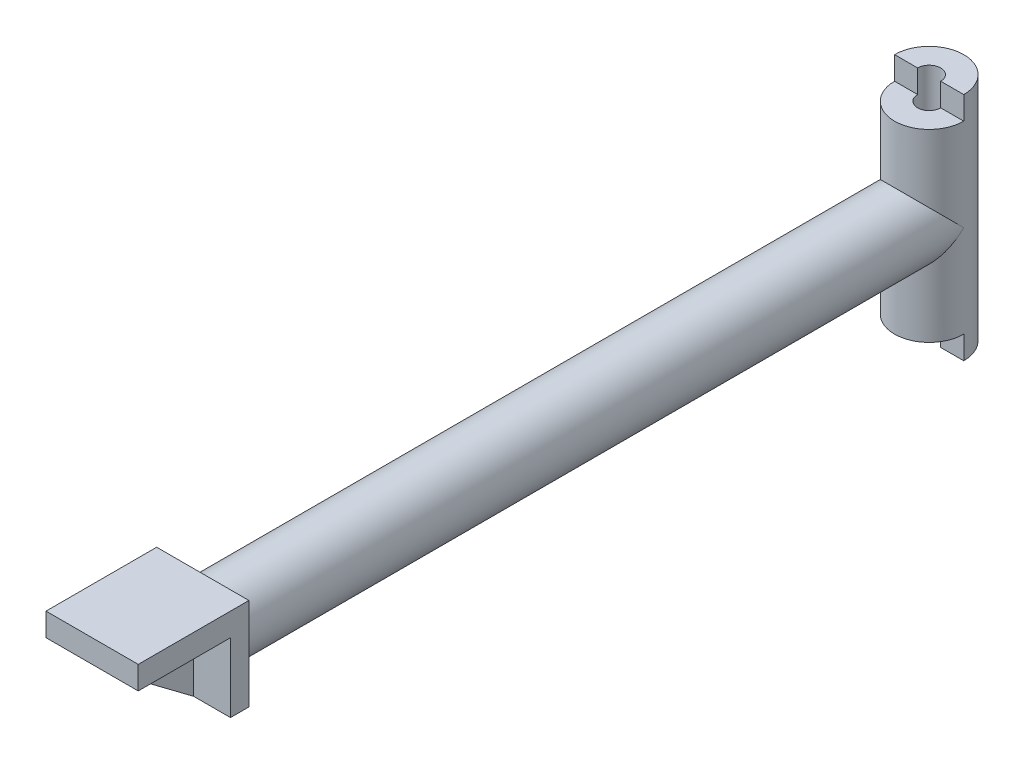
ISO-10303-21;
HEADER;
FILE_DESCRIPTION(('STEP AP214'),'2;1');
FILE_NAME('part.step','',(''),(''),'','','');
FILE_SCHEMA(('AUTOMOTIVE_DESIGN { 1 0 10303 214 1 1 1 1 }'));
ENDSEC;
DATA;
#1=APPLICATION_CONTEXT('core data for automotive mechanical design processes');
#2=APPLICATION_PROTOCOL_DEFINITION('international standard','automotive_design',2000,#1);
#3=PRODUCT_CONTEXT('',#1,'mechanical');
#4=PRODUCT('Part','Part','',(#3));
#5=PRODUCT_RELATED_PRODUCT_CATEGORY('part','',(#4));
#6=PRODUCT_DEFINITION_FORMATION('','',#4);
#7=PRODUCT_DEFINITION_CONTEXT('part definition',#1,'design');
#8=PRODUCT_DEFINITION('design','',#6,#7);
#9=PRODUCT_DEFINITION_SHAPE('','',#8);
#10=(LENGTH_UNIT() NAMED_UNIT(*) SI_UNIT(.MILLI.,.METRE.));
#11=(NAMED_UNIT(*) PLANE_ANGLE_UNIT() SI_UNIT($,.RADIAN.));
#12=(NAMED_UNIT(*) SI_UNIT($,.STERADIAN.) SOLID_ANGLE_UNIT());
#13=UNCERTAINTY_MEASURE_WITH_UNIT(LENGTH_MEASURE(1.E-05),#10,'distance_accuracy_value','');
#14=(GEOMETRIC_REPRESENTATION_CONTEXT(3) GLOBAL_UNCERTAINTY_ASSIGNED_CONTEXT((#13)) GLOBAL_UNIT_ASSIGNED_CONTEXT((#10,
#11,#12)) REPRESENTATION_CONTEXT('',''));
#15=CARTESIAN_POINT('',(0.,0.,0.));
#16=DIRECTION('',(0.,0.,1.));
#17=DIRECTION('',(1.,0.,0.));
#18=AXIS2_PLACEMENT_3D('',#15,#16,#17);
#19=CARTESIAN_POINT('',(0.,0.,195.58));
#20=DIRECTION('',(0.,0.,-1.));
#21=DIRECTION('',(-1.,0.,0.));
#22=AXIS2_PLACEMENT_3D('',#19,#20,#21);
#23=PLANE('',#22);
#24=DIRECTION('',(1.,0.,0.));
#25=VECTOR('',#24,1.);
#26=CARTESIAN_POINT('',(-12.7,6.35,195.58));
#27=LINE('',#26,#25);
#28=CARTESIAN_POINT('',(2.54,6.35,195.58));
#29=VERTEX_POINT('',#28);
#30=CARTESIAN_POINT('',(12.7,6.35,195.58));
#31=VERTEX_POINT('',#30);
#32=EDGE_CURVE('E237',#29,#31,#27,.T.);
#33=ORIENTED_EDGE('',*,*,#32,.F.);
#34=DIRECTION('',(0.,1.,0.));
#35=VECTOR('',#34,1.);
#36=CARTESIAN_POINT('',(2.54,-12.7,195.58));
#37=LINE('',#36,#35);
#38=CARTESIAN_POINT('',(2.54,-12.7,195.58));
#39=VERTEX_POINT('',#38);
#40=EDGE_CURVE('E207',#39,#29,#37,.T.);
#41=ORIENTED_EDGE('',*,*,#40,.F.);
#42=DIRECTION('',(1.,0.,0.));
#43=VECTOR('',#42,1.);
#44=CARTESIAN_POINT('',(-12.7,-12.7,195.58));
#45=LINE('',#44,#43);
#46=CARTESIAN_POINT('',(12.7,-12.7,195.58));
#47=VERTEX_POINT('',#46);
#48=EDGE_CURVE('E323',#39,#47,#45,.T.);
#49=ORIENTED_EDGE('',*,*,#48,.T.);
#50=DIRECTION('',(0.,1.,0.));
#51=VECTOR('',#50,1.);
#52=CARTESIAN_POINT('',(12.7,-12.7,195.58));
#53=LINE('',#52,#51);
#54=EDGE_CURVE('E322',#47,#31,#53,.T.);
#55=ORIENTED_EDGE('',*,*,#54,.T.);
#56=EDGE_LOOP('',(#33,#41,#49,#55));
#57=FACE_BOUND('',#56,.T.);
#58=ADVANCED_FACE('F49',(#57),#23,.F.);
#59=CARTESIAN_POINT('',(-12.7,6.35,220.98));
#60=DIRECTION('',(0.,1.,0.));
#61=DIRECTION('',(0.,0.,1.));
#62=AXIS2_PLACEMENT_3D('',#59,#60,#61);
#63=PLANE('',#62);
#64=DIRECTION('',(1.,0.,0.));
#65=VECTOR('',#64,1.);
#66=CARTESIAN_POINT('',(-12.7,6.35,220.98));
#67=LINE('',#66,#65);
#68=CARTESIAN_POINT('',(2.54,6.35,220.98));
#69=VERTEX_POINT('',#68);
#70=CARTESIAN_POINT('',(12.7,6.35,220.98));
#71=VERTEX_POINT('',#70);
#72=EDGE_CURVE('E217',#69,#71,#67,.T.);
#73=ORIENTED_EDGE('',*,*,#72,.F.);
#74=DIRECTION('',(0.,0.,1.));
#75=VECTOR('',#74,1.);
#76=CARTESIAN_POINT('',(2.54,6.35,195.58));
#77=LINE('',#76,#75);
#78=EDGE_CURVE('E192',#29,#69,#77,.T.);
#79=ORIENTED_EDGE('',*,*,#78,.F.);
#80=ORIENTED_EDGE('',*,*,#32,.T.);
#81=DIRECTION('',(0.,0.,-1.));
#82=VECTOR('',#81,1.);
#83=CARTESIAN_POINT('',(12.7,6.35,220.98));
#84=LINE('',#83,#82);
#85=EDGE_CURVE('E216',#71,#31,#84,.T.);
#86=ORIENTED_EDGE('',*,*,#85,.F.);
#87=EDGE_LOOP('',(#73,#79,#80,#86));
#88=FACE_BOUND('',#87,.T.);
#89=ADVANCED_FACE('F318',(#88),#63,.F.);
#90=CARTESIAN_POINT('',(-12.7,-12.7,195.58));
#91=VERTEX_POINT('',#90);
#92=CARTESIAN_POINT('',(-2.54,-12.7,195.58));
#93=VERTEX_POINT('',#92);
#94=EDGE_CURVE('E359',#91,#93,#45,.T.);
#95=ORIENTED_EDGE('',*,*,#94,.T.);
#96=DIRECTION('',(0.,-1.,0.));
#97=VECTOR('',#96,1.);
#98=CARTESIAN_POINT('',(-2.54,-12.7,195.58));
#99=LINE('',#98,#97);
#100=CARTESIAN_POINT('',(-2.54,6.35,195.58));
#101=VERTEX_POINT('',#100);
#102=EDGE_CURVE('E196',#101,#93,#99,.T.);
#103=ORIENTED_EDGE('',*,*,#102,.F.);
#104=CARTESIAN_POINT('',(-12.7,6.35,195.58));
#105=VERTEX_POINT('',#104);
#106=EDGE_CURVE('E76',#105,#101,#27,.T.);
#107=ORIENTED_EDGE('',*,*,#106,.F.);
#108=DIRECTION('',(0.,-1.,0.));
#109=VECTOR('',#108,1.);
#110=CARTESIAN_POINT('',(-12.7,-12.7,195.58));
#111=LINE('',#110,#109);
#112=EDGE_CURVE('E328',#105,#91,#111,.T.);
#113=ORIENTED_EDGE('',*,*,#112,.T.);
#114=EDGE_LOOP('',(#95,#103,#107,#113));
#115=FACE_BOUND('',#114,.T.);
#116=ADVANCED_FACE('F567',(#115),#23,.F.);
#117=CARTESIAN_POINT('',(0.,0.,190.5));
#118=DIRECTION('',(0.,0.,-1.));
#119=DIRECTION('',(-1.,0.,0.));
#120=AXIS2_PLACEMENT_3D('',#117,#118,#119);
#121=CYLINDRICAL_SURFACE('',#120,9.525);
#122=CARTESIAN_POINT('',(0.,0.,190.5));
#123=DIRECTION('',(0.,0.,1.));
#124=DIRECTION('',(1.,0.,0.));
#125=AXIS2_PLACEMENT_3D('',#122,#123,#124);
#126=CIRCLE('',#125,9.525);
#127=CARTESIAN_POINT('',(9.525,0.,190.5));
#128=VERTEX_POINT('',#127);
#129=EDGE_CURVE('E12',#128,#128,#126,.T.);
#130=ORIENTED_EDGE('',*,*,#129,.F.);
#131=EDGE_LOOP('',(#130));
#132=FACE_BOUND('',#131,.T.);
#133=CARTESIAN_POINT('',(0.,0.,-9.525));
#134=DIRECTION('',(0.,0.707106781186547,0.707106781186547));
#135=DIRECTION('',(0.,-0.707106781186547,0.707106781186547));
#136=AXIS2_PLACEMENT_3D('',#133,#134,#135);
#137=ELLIPSE('',#136,13.4703841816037,9.525);
#138=CARTESIAN_POINT('',(-9.525,0.,-9.525));
#139=VERTEX_POINT('',#138);
#140=CARTESIAN_POINT('',(9.525,0.,-9.525));
#141=VERTEX_POINT('',#140);
#142=EDGE_CURVE('E61',#139,#141,#137,.T.);
#143=ORIENTED_EDGE('',*,*,#142,.T.);
#144=CARTESIAN_POINT('',(0.,0.,-9.525));
#145=DIRECTION('',(0.,-0.707106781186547,0.707106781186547));
#146=DIRECTION('',(0.,0.707106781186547,0.707106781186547));
#147=AXIS2_PLACEMENT_3D('',#144,#145,#146);
#148=ELLIPSE('',#147,13.4703841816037,9.525);
#149=EDGE_CURVE('E475',#141,#139,#148,.T.);
#150=ORIENTED_EDGE('',*,*,#149,.T.);
#151=EDGE_LOOP('',(#143,#150));
#152=FACE_BOUND('',#151,.T.);
#153=ADVANCED_FACE('F51',(#132,#152),#121,.T.);
#154=CARTESIAN_POINT('',(0.,25.4,-9.525));
#155=DIRECTION('',(0.,-1.,0.));
#156=DIRECTION('',(0.,0.,-1.));
#157=AXIS2_PLACEMENT_3D('',#154,#155,#156);
#158=CYLINDRICAL_SURFACE('',#157,9.525);
#159=ORIENTED_EDGE('',*,*,#149,.F.);
#160=ORIENTED_EDGE('',*,*,#142,.F.);
#161=EDGE_LOOP('',(#159,#160));
#162=FACE_BOUND('',#161,.T.);
#163=CARTESIAN_POINT('',(0.,25.4,-9.525));
#164=DIRECTION('',(0.,1.,0.));
#165=DIRECTION('',(0.,0.,1.));
#166=AXIS2_PLACEMENT_3D('',#163,#164,#165);
#167=CIRCLE('',#166,9.525);
#168=CARTESIAN_POINT('',(-9.525,25.4,-9.525));
#169=VERTEX_POINT('',#168);
#170=CARTESIAN_POINT('',(9.525,25.4,-9.525));
#171=VERTEX_POINT('',#170);
#172=EDGE_CURVE('E465',#169,#171,#167,.T.);
#173=ORIENTED_EDGE('',*,*,#172,.F.);
#174=DIRECTION('',(0.,-1.,0.));
#175=VECTOR('',#174,1.);
#176=CARTESIAN_POINT('',(-9.525,31.75,-9.525));
#177=LINE('',#176,#175);
#178=CARTESIAN_POINT('',(-9.525,31.75,-9.525));
#179=VERTEX_POINT('',#178);
#180=EDGE_CURVE('E452',#179,#169,#177,.T.);
#181=ORIENTED_EDGE('',*,*,#180,.F.);
#182=CARTESIAN_POINT('',(0.,31.75,-9.525));
#183=DIRECTION('',(0.,1.,0.));
#184=DIRECTION('',(0.,0.,-1.));
#185=AXIS2_PLACEMENT_3D('',#182,#183,#184);
#186=CIRCLE('',#185,9.525);
#187=CARTESIAN_POINT('',(9.525,31.75,-9.525));
#188=VERTEX_POINT('',#187);
#189=EDGE_CURVE('E420',#188,#179,#186,.T.);
#190=ORIENTED_EDGE('',*,*,#189,.F.);
#191=DIRECTION('',(0.,-1.,0.));
#192=VECTOR('',#191,1.);
#193=CARTESIAN_POINT('',(9.525,31.75,-9.525));
#194=LINE('',#193,#192);
#195=EDGE_CURVE('E434',#188,#171,#194,.T.);
#196=ORIENTED_EDGE('',*,*,#195,.T.);
#197=EDGE_LOOP('',(#173,#181,#190,#196));
#198=FACE_BOUND('',#197,.T.);
#199=CARTESIAN_POINT('',(0.,-25.4,-9.525));
#200=DIRECTION('',(0.,1.,0.));
#201=DIRECTION('',(0.,0.,1.));
#202=AXIS2_PLACEMENT_3D('',#199,#200,#201);
#203=CIRCLE('',#202,9.525);
#204=CARTESIAN_POINT('',(-9.525,-25.4,-9.525));
#205=VERTEX_POINT('',#204);
#206=CARTESIAN_POINT('',(9.525,-25.4,-9.525));
#207=VERTEX_POINT('',#206);
#208=EDGE_CURVE('E461',#205,#207,#203,.T.);
#209=ORIENTED_EDGE('',*,*,#208,.T.);
#210=DIRECTION('',(0.,1.,0.));
#211=VECTOR('',#210,1.);
#212=CARTESIAN_POINT('',(9.525,-31.75,-9.525));
#213=LINE('',#212,#211);
#214=CARTESIAN_POINT('',(9.525,-31.75,-9.525));
#215=VERTEX_POINT('',#214);
#216=EDGE_CURVE('E416',#215,#207,#213,.T.);
#217=ORIENTED_EDGE('',*,*,#216,.F.);
#218=CARTESIAN_POINT('',(0.,-31.75,-9.525));
#219=DIRECTION('',(0.,1.,0.));
#220=DIRECTION('',(0.,0.,-1.));
#221=AXIS2_PLACEMENT_3D('',#218,#219,#220);
#222=CIRCLE('',#221,9.525);
#223=CARTESIAN_POINT('',(-9.525,-31.75,-9.525));
#224=VERTEX_POINT('',#223);
#225=EDGE_CURVE('E383',#215,#224,#222,.T.);
#226=ORIENTED_EDGE('',*,*,#225,.T.);
#227=DIRECTION('',(0.,1.,0.));
#228=VECTOR('',#227,1.);
#229=CARTESIAN_POINT('',(-9.525,-31.75,-9.525));
#230=LINE('',#229,#228);
#231=EDGE_CURVE('E400',#224,#205,#230,.T.);
#232=ORIENTED_EDGE('',*,*,#231,.T.);
#233=EDGE_LOOP('',(#209,#217,#226,#232));
#234=FACE_BOUND('',#233,.T.);
#235=ADVANCED_FACE('F488',(#162,#198,#234),#158,.T.);
#236=CARTESIAN_POINT('',(0.,25.4,-9.525));
#237=DIRECTION('',(0.,1.,0.));
#238=DIRECTION('',(0.,0.,1.));
#239=AXIS2_PLACEMENT_3D('',#236,#237,#238);
#240=PLANE('',#239);
#241=DIRECTION('',(1.,0.,0.));
#242=VECTOR('',#241,1.);
#243=CARTESIAN_POINT('',(3.175,25.4,-9.525));
#244=LINE('',#243,#242);
#245=CARTESIAN_POINT('',(3.175,25.4,-9.525));
#246=VERTEX_POINT('',#245);
#247=EDGE_CURVE('E425',#246,#171,#244,.T.);
#248=ORIENTED_EDGE('',*,*,#247,.F.);
#249=CARTESIAN_POINT('',(0.,25.4,-9.525));
#250=DIRECTION('',(0.,1.,0.));
#251=DIRECTION('',(0.,0.,1.));
#252=AXIS2_PLACEMENT_3D('',#249,#250,#251);
#253=CIRCLE('',#252,3.175);
#254=CARTESIAN_POINT('',(-3.175,25.4,-9.525));
#255=VERTEX_POINT('',#254);
#256=EDGE_CURVE('E457',#255,#246,#253,.T.);
#257=ORIENTED_EDGE('',*,*,#256,.F.);
#258=DIRECTION('',(1.,0.,0.));
#259=VECTOR('',#258,1.);
#260=CARTESIAN_POINT('',(-9.525,25.4,-9.525));
#261=LINE('',#260,#259);
#262=EDGE_CURVE('E419',#169,#255,#261,.T.);
#263=ORIENTED_EDGE('',*,*,#262,.F.);
#264=ORIENTED_EDGE('',*,*,#172,.T.);
#265=EDGE_LOOP('',(#248,#257,#263,#264));
#266=FACE_BOUND('',#265,.T.);
#267=ADVANCED_FACE('F491',(#266),#240,.T.);
#268=CARTESIAN_POINT('',(0.,-25.4,-9.525));
#269=DIRECTION('',(0.,1.,0.));
#270=DIRECTION('',(0.,0.,1.));
#271=AXIS2_PLACEMENT_3D('',#268,#269,#270);
#272=PLANE('',#271);
#273=ORIENTED_EDGE('',*,*,#208,.F.);
#274=DIRECTION('',(1.,0.,0.));
#275=VECTOR('',#274,1.);
#276=CARTESIAN_POINT('',(-9.525,-25.4,-9.525));
#277=LINE('',#276,#275);
#278=CARTESIAN_POINT('',(-3.175,-25.4,-9.525));
#279=VERTEX_POINT('',#278);
#280=EDGE_CURVE('E388',#205,#279,#277,.T.);
#281=ORIENTED_EDGE('',*,*,#280,.T.);
#282=CARTESIAN_POINT('',(0.,-25.4,-9.525));
#283=DIRECTION('',(0.,1.,0.));
#284=DIRECTION('',(0.,0.,1.));
#285=AXIS2_PLACEMENT_3D('',#282,#283,#284);
#286=CIRCLE('',#285,3.175);
#287=CARTESIAN_POINT('',(3.175,-25.4,-9.525));
#288=VERTEX_POINT('',#287);
#289=EDGE_CURVE('E456',#279,#288,#286,.T.);
#290=ORIENTED_EDGE('',*,*,#289,.T.);
#291=DIRECTION('',(1.,0.,0.));
#292=VECTOR('',#291,1.);
#293=CARTESIAN_POINT('',(3.175,-25.4,-9.525));
#294=LINE('',#293,#292);
#295=EDGE_CURVE('E401',#288,#207,#294,.T.);
#296=ORIENTED_EDGE('',*,*,#295,.T.);
#297=EDGE_LOOP('',(#273,#281,#290,#296));
#298=FACE_BOUND('',#297,.T.);
#299=ADVANCED_FACE('F494',(#298),#272,.F.);
#300=CARTESIAN_POINT('',(0.,25.4,-9.525));
#301=DIRECTION('',(0.,-1.,0.));
#302=DIRECTION('',(0.,0.,-1.));
#303=AXIS2_PLACEMENT_3D('',#300,#301,#302);
#304=CYLINDRICAL_SURFACE('',#303,3.175);
#305=ORIENTED_EDGE('',*,*,#256,.T.);
#306=DIRECTION('',(0.,-1.,0.));
#307=VECTOR('',#306,1.);
#308=CARTESIAN_POINT('',(3.175,31.75,-9.525));
#309=LINE('',#308,#307);
#310=CARTESIAN_POINT('',(3.175,31.75,-9.525));
#311=VERTEX_POINT('',#310);
#312=EDGE_CURVE('E444',#311,#246,#309,.T.);
#313=ORIENTED_EDGE('',*,*,#312,.F.);
#314=CARTESIAN_POINT('',(0.,31.75,-9.525));
#315=DIRECTION('',(0.,-1.,0.));
#316=DIRECTION('',(0.,0.,-1.));
#317=AXIS2_PLACEMENT_3D('',#314,#315,#316);
#318=CIRCLE('',#317,3.175);
#319=CARTESIAN_POINT('',(-3.175,31.75,-9.525));
#320=VERTEX_POINT('',#319);
#321=EDGE_CURVE('E428',#320,#311,#318,.T.);
#322=ORIENTED_EDGE('',*,*,#321,.F.);
#323=DIRECTION('',(0.,-1.,0.));
#324=VECTOR('',#323,1.);
#325=CARTESIAN_POINT('',(-3.175,31.75,-9.525));
#326=LINE('',#325,#324);
#327=EDGE_CURVE('E448',#320,#255,#326,.T.);
#328=ORIENTED_EDGE('',*,*,#327,.T.);
#329=EDGE_LOOP('',(#305,#313,#322,#328));
#330=FACE_BOUND('',#329,.T.);
#331=ORIENTED_EDGE('',*,*,#289,.F.);
#332=DIRECTION('',(0.,1.,0.));
#333=VECTOR('',#332,1.);
#334=CARTESIAN_POINT('',(-3.175,-31.75,-9.525));
#335=LINE('',#334,#333);
#336=CARTESIAN_POINT('',(-3.175,-31.75,-9.525));
#337=VERTEX_POINT('',#336);
#338=EDGE_CURVE('E410',#337,#279,#335,.T.);
#339=ORIENTED_EDGE('',*,*,#338,.F.);
#340=CARTESIAN_POINT('',(0.,-31.75,-9.525));
#341=DIRECTION('',(0.,-1.,0.));
#342=DIRECTION('',(0.,0.,-1.));
#343=AXIS2_PLACEMENT_3D('',#340,#341,#342);
#344=CIRCLE('',#343,3.175);
#345=CARTESIAN_POINT('',(3.175,-31.75,-9.525));
#346=VERTEX_POINT('',#345);
#347=EDGE_CURVE('E392',#337,#346,#344,.T.);
#348=ORIENTED_EDGE('',*,*,#347,.T.);
#349=DIRECTION('',(0.,1.,0.));
#350=VECTOR('',#349,1.);
#351=CARTESIAN_POINT('',(3.175,-31.75,-9.525));
#352=LINE('',#351,#350);
#353=EDGE_CURVE('E413',#346,#288,#352,.T.);
#354=ORIENTED_EDGE('',*,*,#353,.T.);
#355=EDGE_LOOP('',(#331,#339,#348,#354));
#356=FACE_BOUND('',#355,.T.);
#357=ADVANCED_FACE('F497',(#330,#356),#304,.F.);
#358=CARTESIAN_POINT('',(-9.525,31.75,-9.525));
#359=DIRECTION('',(0.,0.,-1.));
#360=DIRECTION('',(-1.,0.,0.));
#361=AXIS2_PLACEMENT_3D('',#358,#359,#360);
#362=PLANE('',#361);
#363=ORIENTED_EDGE('',*,*,#262,.T.);
#364=ORIENTED_EDGE('',*,*,#327,.F.);
#365=DIRECTION('',(1.,0.,0.));
#366=VECTOR('',#365,1.);
#367=CARTESIAN_POINT('',(-9.525,31.75,-9.525));
#368=LINE('',#367,#366);
#369=EDGE_CURVE('E424',#179,#320,#368,.T.);
#370=ORIENTED_EDGE('',*,*,#369,.F.);
#371=ORIENTED_EDGE('',*,*,#180,.T.);
#372=EDGE_LOOP('',(#363,#364,#370,#371));
#373=FACE_BOUND('',#372,.T.);
#374=ADVANCED_FACE('F504',(#373),#362,.F.);
#375=CARTESIAN_POINT('',(3.175,31.75,-9.525));
#376=DIRECTION('',(0.,0.,-1.));
#377=DIRECTION('',(-1.,0.,0.));
#378=AXIS2_PLACEMENT_3D('',#375,#376,#377);
#379=PLANE('',#378);
#380=ORIENTED_EDGE('',*,*,#247,.T.);
#381=ORIENTED_EDGE('',*,*,#195,.F.);
#382=DIRECTION('',(1.,0.,0.));
#383=VECTOR('',#382,1.);
#384=CARTESIAN_POINT('',(3.175,31.75,-9.525));
#385=LINE('',#384,#383);
#386=EDGE_CURVE('E431',#311,#188,#385,.T.);
#387=ORIENTED_EDGE('',*,*,#386,.F.);
#388=ORIENTED_EDGE('',*,*,#312,.T.);
#389=EDGE_LOOP('',(#380,#381,#387,#388));
#390=FACE_BOUND('',#389,.T.);
#391=ADVANCED_FACE('F508',(#390),#379,.F.);
#392=CARTESIAN_POINT('',(0.,31.75,-9.525));
#393=DIRECTION('',(0.,-1.,0.));
#394=DIRECTION('',(0.,0.,-1.));
#395=AXIS2_PLACEMENT_3D('',#392,#393,#394);
#396=PLANE('',#395);
#397=ORIENTED_EDGE('',*,*,#189,.T.);
#398=ORIENTED_EDGE('',*,*,#369,.T.);
#399=ORIENTED_EDGE('',*,*,#321,.T.);
#400=ORIENTED_EDGE('',*,*,#386,.T.);
#401=EDGE_LOOP('',(#397,#398,#399,#400));
#402=FACE_BOUND('',#401,.T.);
#403=ADVANCED_FACE('F512',(#402),#396,.F.);
#404=CARTESIAN_POINT('',(3.175,-31.75,-9.525));
#405=DIRECTION('',(0.,0.,1.));
#406=DIRECTION('',(1.,0.,0.));
#407=AXIS2_PLACEMENT_3D('',#404,#405,#406);
#408=PLANE('',#407);
#409=ORIENTED_EDGE('',*,*,#295,.F.);
#410=ORIENTED_EDGE('',*,*,#353,.F.);
#411=DIRECTION('',(1.,0.,0.));
#412=VECTOR('',#411,1.);
#413=CARTESIAN_POINT('',(3.175,-31.75,-9.525));
#414=LINE('',#413,#412);
#415=EDGE_CURVE('E387',#346,#215,#414,.T.);
#416=ORIENTED_EDGE('',*,*,#415,.T.);
#417=ORIENTED_EDGE('',*,*,#216,.T.);
#418=EDGE_LOOP('',(#409,#410,#416,#417));
#419=FACE_BOUND('',#418,.T.);
#420=ADVANCED_FACE('F516',(#419),#408,.T.);
#421=CARTESIAN_POINT('',(-9.525,-31.75,-9.525));
#422=DIRECTION('',(0.,0.,1.));
#423=DIRECTION('',(1.,0.,0.));
#424=AXIS2_PLACEMENT_3D('',#421,#422,#423);
#425=PLANE('',#424);
#426=ORIENTED_EDGE('',*,*,#280,.F.);
#427=ORIENTED_EDGE('',*,*,#231,.F.);
#428=DIRECTION('',(1.,0.,0.));
#429=VECTOR('',#428,1.);
#430=CARTESIAN_POINT('',(-9.525,-31.75,-9.525));
#431=LINE('',#430,#429);
#432=EDGE_CURVE('E396',#224,#337,#431,.T.);
#433=ORIENTED_EDGE('',*,*,#432,.T.);
#434=ORIENTED_EDGE('',*,*,#338,.T.);
#435=EDGE_LOOP('',(#426,#427,#433,#434));
#436=FACE_BOUND('',#435,.T.);
#437=ADVANCED_FACE('F520',(#436),#425,.T.);
#438=CARTESIAN_POINT('',(0.,-31.75,-9.525));
#439=DIRECTION('',(0.,1.,0.));
#440=DIRECTION('',(0.,0.,-1.));
#441=AXIS2_PLACEMENT_3D('',#438,#439,#440);
#442=PLANE('',#441);
#443=ORIENTED_EDGE('',*,*,#225,.F.);
#444=ORIENTED_EDGE('',*,*,#415,.F.);
#445=ORIENTED_EDGE('',*,*,#347,.F.);
#446=ORIENTED_EDGE('',*,*,#432,.F.);
#447=EDGE_LOOP('',(#443,#444,#445,#446));
#448=FACE_BOUND('',#447,.T.);
#449=ADVANCED_FACE('F524',(#448),#442,.F.);
#450=CARTESIAN_POINT('',(12.7,-12.7,195.58));
#451=DIRECTION('',(-1.,0.,0.));
#452=DIRECTION('',(0.,0.,1.));
#453=AXIS2_PLACEMENT_3D('',#450,#451,#452);
#454=PLANE('',#453);
#455=DIRECTION('',(0.,1.,0.));
#456=VECTOR('',#455,1.);
#457=CARTESIAN_POINT('',(12.7,-12.7,190.5));
#458=LINE('',#457,#456);
#459=CARTESIAN_POINT('',(12.7,-12.7,190.5));
#460=VERTEX_POINT('',#459);
#461=CARTESIAN_POINT('',(12.7,12.7,190.5));
#462=VERTEX_POINT('',#461);
#463=EDGE_CURVE('E347',#460,#462,#458,.T.);
#464=ORIENTED_EDGE('',*,*,#463,.T.);
#465=DIRECTION('',(0.,0.,-1.));
#466=VECTOR('',#465,1.);
#467=CARTESIAN_POINT('',(12.7,12.7,195.58));
#468=LINE('',#467,#466);
#469=CARTESIAN_POINT('',(12.7,12.7,220.98));
#470=VERTEX_POINT('',#469);
#471=EDGE_CURVE('E335',#470,#462,#468,.T.);
#472=ORIENTED_EDGE('',*,*,#471,.F.);
#473=DIRECTION('',(0.,1.,0.));
#474=VECTOR('',#473,1.);
#475=CARTESIAN_POINT('',(12.7,6.35,220.98));
#476=LINE('',#475,#474);
#477=EDGE_CURVE('E240',#71,#470,#476,.T.);
#478=ORIENTED_EDGE('',*,*,#477,.F.);
#479=ORIENTED_EDGE('',*,*,#85,.T.);
#480=ORIENTED_EDGE('',*,*,#54,.F.);
#481=DIRECTION('',(0.,0.,-1.));
#482=VECTOR('',#481,1.);
#483=CARTESIAN_POINT('',(12.7,-12.7,195.58));
#484=LINE('',#483,#482);
#485=EDGE_CURVE('E362',#47,#460,#484,.T.);
#486=ORIENTED_EDGE('',*,*,#485,.T.);
#487=EDGE_LOOP('',(#464,#472,#478,#479,#480,#486));
#488=FACE_BOUND('',#487,.T.);
#489=ADVANCED_FACE('F333',(#488),#454,.F.);
#490=CARTESIAN_POINT('',(-12.7,12.7,195.58));
#491=DIRECTION('',(0.,-1.,0.));
#492=DIRECTION('',(0.,0.,-1.));
#493=AXIS2_PLACEMENT_3D('',#490,#491,#492);
#494=PLANE('',#493);
#495=DIRECTION('',(-1.,0.,0.));
#496=VECTOR('',#495,1.);
#497=CARTESIAN_POINT('',(-12.7,12.7,190.5));
#498=LINE('',#497,#496);
#499=CARTESIAN_POINT('',(-12.7,12.7,190.5));
#500=VERTEX_POINT('',#499);
#501=EDGE_CURVE('E349',#462,#500,#498,.T.);
#502=ORIENTED_EDGE('',*,*,#501,.T.);
#503=DIRECTION('',(0.,0.,-1.));
#504=VECTOR('',#503,1.);
#505=CARTESIAN_POINT('',(-12.7,12.7,195.58));
#506=LINE('',#505,#504);
#507=CARTESIAN_POINT('',(-12.7,12.7,220.98));
#508=VERTEX_POINT('',#507);
#509=EDGE_CURVE('E342',#508,#500,#506,.T.);
#510=ORIENTED_EDGE('',*,*,#509,.F.);
#511=DIRECTION('',(-1.,0.,0.));
#512=VECTOR('',#511,1.);
#513=CARTESIAN_POINT('',(-12.7,12.7,220.98));
#514=LINE('',#513,#512);
#515=EDGE_CURVE('E243',#470,#508,#514,.T.);
#516=ORIENTED_EDGE('',*,*,#515,.F.);
#517=ORIENTED_EDGE('',*,*,#471,.T.);
#518=EDGE_LOOP('',(#502,#510,#516,#517));
#519=FACE_BOUND('',#518,.T.);
#520=ADVANCED_FACE('F531',(#519),#494,.F.);
#521=CARTESIAN_POINT('',(-12.7,-12.7,195.58));
#522=DIRECTION('',(1.,0.,0.));
#523=DIRECTION('',(0.,0.,-1.));
#524=AXIS2_PLACEMENT_3D('',#521,#522,#523);
#525=PLANE('',#524);
#526=DIRECTION('',(0.,-1.,0.));
#527=VECTOR('',#526,1.);
#528=CARTESIAN_POINT('',(-12.7,-12.7,190.5));
#529=LINE('',#528,#527);
#530=CARTESIAN_POINT('',(-12.7,-12.7,190.5));
#531=VERTEX_POINT('',#530);
#532=EDGE_CURVE('E370',#500,#531,#529,.T.);
#533=ORIENTED_EDGE('',*,*,#532,.T.);
#534=DIRECTION('',(0.,0.,-1.));
#535=VECTOR('',#534,1.);
#536=CARTESIAN_POINT('',(-12.7,-12.7,195.58));
#537=LINE('',#536,#535);
#538=EDGE_CURVE('E366',#91,#531,#537,.T.);
#539=ORIENTED_EDGE('',*,*,#538,.F.);
#540=ORIENTED_EDGE('',*,*,#112,.F.);
#541=DIRECTION('',(0.,0.,-1.));
#542=VECTOR('',#541,1.);
#543=CARTESIAN_POINT('',(-12.7,6.35,220.98));
#544=LINE('',#543,#542);
#545=CARTESIAN_POINT('',(-12.7,6.35,220.98));
#546=VERTEX_POINT('',#545);
#547=EDGE_CURVE('E222',#546,#105,#544,.T.);
#548=ORIENTED_EDGE('',*,*,#547,.F.);
#549=DIRECTION('',(0.,-1.,0.));
#550=VECTOR('',#549,1.);
#551=CARTESIAN_POINT('',(-12.7,6.35,220.98));
#552=LINE('',#551,#550);
#553=EDGE_CURVE('E213',#508,#546,#552,.T.);
#554=ORIENTED_EDGE('',*,*,#553,.F.);
#555=ORIENTED_EDGE('',*,*,#509,.T.);
#556=EDGE_LOOP('',(#533,#539,#540,#548,#554,#555));
#557=FACE_BOUND('',#556,.T.);
#558=ADVANCED_FACE('F341',(#557),#525,.F.);
#559=CARTESIAN_POINT('',(-12.7,-12.7,195.58));
#560=DIRECTION('',(0.,1.,0.));
#561=DIRECTION('',(0.,0.,1.));
#562=AXIS2_PLACEMENT_3D('',#559,#560,#561);
#563=PLANE('',#562);
#564=DIRECTION('',(1.,0.,0.));
#565=VECTOR('',#564,1.);
#566=CARTESIAN_POINT('',(-12.7,-12.7,190.5));
#567=LINE('',#566,#565);
#568=EDGE_CURVE('E329',#531,#460,#567,.T.);
#569=ORIENTED_EDGE('',*,*,#568,.T.);
#570=ORIENTED_EDGE('',*,*,#485,.F.);
#571=ORIENTED_EDGE('',*,*,#48,.F.);
#572=DIRECTION('',(1.,0.,0.));
#573=VECTOR('',#572,1.);
#574=CARTESIAN_POINT('',(-2.54,-12.7,195.58));
#575=LINE('',#574,#573);
#576=EDGE_CURVE('E198',#93,#39,#575,.T.);
#577=ORIENTED_EDGE('',*,*,#576,.F.);
#578=ORIENTED_EDGE('',*,*,#94,.F.);
#579=ORIENTED_EDGE('',*,*,#538,.T.);
#580=EDGE_LOOP('',(#569,#570,#571,#577,#578,#579));
#581=FACE_BOUND('',#580,.T.);
#582=ADVANCED_FACE('F536',(#581),#563,.F.);
#583=CARTESIAN_POINT('',(0.,0.,190.5));
#584=DIRECTION('',(0.,0.,-1.));
#585=DIRECTION('',(-1.,0.,0.));
#586=AXIS2_PLACEMENT_3D('',#583,#584,#585);
#587=PLANE('',#586);
#588=ORIENTED_EDGE('',*,*,#129,.T.);
#589=EDGE_LOOP('',(#588));
#590=FACE_BOUND('',#589,.T.);
#591=ORIENTED_EDGE('',*,*,#463,.F.);
#592=ORIENTED_EDGE('',*,*,#568,.F.);
#593=ORIENTED_EDGE('',*,*,#532,.F.);
#594=ORIENTED_EDGE('',*,*,#501,.F.);
#595=EDGE_LOOP('',(#591,#592,#593,#594));
#596=FACE_BOUND('',#595,.T.);
#597=ADVANCED_FACE('F540',(#590,#596),#587,.T.);
#598=ORIENTED_EDGE('',*,*,#106,.T.);
#599=DIRECTION('',(0.,0.,-1.));
#600=VECTOR('',#599,1.);
#601=CARTESIAN_POINT('',(-2.54,6.35,195.58));
#602=LINE('',#601,#600);
#603=CARTESIAN_POINT('',(-2.54,6.35,220.98));
#604=VERTEX_POINT('',#603);
#605=EDGE_CURVE('E69',#604,#101,#602,.T.);
#606=ORIENTED_EDGE('',*,*,#605,.F.);
#607=EDGE_CURVE('E205',#546,#604,#67,.T.);
#608=ORIENTED_EDGE('',*,*,#607,.F.);
#609=ORIENTED_EDGE('',*,*,#547,.T.);
#610=EDGE_LOOP('',(#598,#606,#608,#609));
#611=FACE_BOUND('',#610,.T.);
#612=ADVANCED_FACE('F203',(#611),#63,.F.);
#613=CARTESIAN_POINT('',(0.,0.,220.98));
#614=DIRECTION('',(0.,0.,-1.));
#615=DIRECTION('',(-1.,0.,0.));
#616=AXIS2_PLACEMENT_3D('',#613,#614,#615);
#617=PLANE('',#616);
#618=ORIENTED_EDGE('',*,*,#477,.T.);
#619=ORIENTED_EDGE('',*,*,#515,.T.);
#620=ORIENTED_EDGE('',*,*,#553,.T.);
#621=ORIENTED_EDGE('',*,*,#607,.T.);
#622=DIRECTION('',(-1.,0.,0.));
#623=VECTOR('',#622,1.);
#624=CARTESIAN_POINT('',(-2.54,6.35,220.98));
#625=LINE('',#624,#623);
#626=EDGE_CURVE('E181',#69,#604,#625,.T.);
#627=ORIENTED_EDGE('',*,*,#626,.F.);
#628=ORIENTED_EDGE('',*,*,#72,.T.);
#629=EDGE_LOOP('',(#618,#619,#620,#621,#627,#628));
#630=FACE_BOUND('',#629,.T.);
#631=ADVANCED_FACE('F210',(#630),#617,.F.);
#632=CARTESIAN_POINT('',(2.54,6.35,195.58));
#633=DIRECTION('',(1.,0.,0.));
#634=DIRECTION('',(0.,0.,1.));
#635=AXIS2_PLACEMENT_3D('',#632,#633,#634);
#636=PLANE('',#635);
#637=ORIENTED_EDGE('',*,*,#78,.T.);
#638=DIRECTION('',(0.,-0.6,-0.8));
#639=VECTOR('',#638,1.);
#640=CARTESIAN_POINT('',(2.54,-3.175,208.28));
#641=LINE('',#640,#639);
#642=EDGE_CURVE('E186',#69,#39,#641,.T.);
#643=ORIENTED_EDGE('',*,*,#642,.T.);
#644=ORIENTED_EDGE('',*,*,#40,.T.);
#645=EDGE_LOOP('',(#637,#643,#644));
#646=FACE_BOUND('',#645,.T.);
#647=ADVANCED_FACE('F277',(#646),#636,.T.);
#648=CARTESIAN_POINT('',(-2.54,6.35,220.98));
#649=DIRECTION('',(-1.,0.,0.));
#650=DIRECTION('',(0.,0.,-1.));
#651=AXIS2_PLACEMENT_3D('',#648,#649,#650);
#652=PLANE('',#651);
#653=ORIENTED_EDGE('',*,*,#605,.T.);
#654=ORIENTED_EDGE('',*,*,#102,.T.);
#655=DIRECTION('',(0.,0.6,0.8));
#656=VECTOR('',#655,1.);
#657=CARTESIAN_POINT('',(-2.54,-3.175,208.28));
#658=LINE('',#657,#656);
#659=EDGE_CURVE('E53',#93,#604,#658,.T.);
#660=ORIENTED_EDGE('',*,*,#659,.T.);
#661=EDGE_LOOP('',(#653,#654,#660));
#662=FACE_BOUND('',#661,.T.);
#663=ADVANCED_FACE('F195',(#662),#652,.T.);
#664=CARTESIAN_POINT('',(0.,-102.0064,76.5048));
#665=DIRECTION('',(0.,-0.8,0.6));
#666=DIRECTION('',(0.,-0.6,-0.8));
#667=AXIS2_PLACEMENT_3D('',#664,#665,#666);
#668=PLANE('',#667);
#669=ORIENTED_EDGE('',*,*,#659,.F.);
#670=ORIENTED_EDGE('',*,*,#576,.T.);
#671=ORIENTED_EDGE('',*,*,#642,.F.);
#672=ORIENTED_EDGE('',*,*,#626,.T.);
#673=EDGE_LOOP('',(#669,#670,#671,#672));
#674=FACE_BOUND('',#673,.T.);
#675=ADVANCED_FACE('F182',(#674),#668,.T.);
#676=CLOSED_SHELL('',(#58,#89,#116,#153,#235,#267,#299,#357,#374,#391,#403,#420,#437,#449,#489,
#520,#558,#582,#597,#612,#631,#647,#663,#675));
#677=CARTESIAN_POINT('',(3.175,0.,-0.544743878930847));
#678=CARTESIAN_POINT('',(3.17500081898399,0.172936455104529,-0.544744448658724));
#679=CARTESIAN_POINT('',(3.16082293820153,0.345867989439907,-0.539693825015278));
#680=CARTESIAN_POINT('',(3.10467734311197,0.686607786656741,-0.520142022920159));
#681=CARTESIAN_POINT('',(3.06270505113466,0.85441520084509,-0.505639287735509));
#682=CARTESIAN_POINT('',(2.95260866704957,1.17991538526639,-0.469004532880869));
#683=CARTESIAN_POINT('',(2.8845358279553,1.33762727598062,-0.446887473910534));
#684=CARTESIAN_POINT('',(2.72434567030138,1.63944315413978,-0.397537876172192));
#685=CARTESIAN_POINT('',(2.63222304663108,1.78354412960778,-0.370304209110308));
#686=CARTESIAN_POINT('',(2.42268738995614,2.05968588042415,-0.312594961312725));
#687=CARTESIAN_POINT('',(2.30449228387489,2.19111648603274,-0.282038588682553));
#688=CARTESIAN_POINT('',(2.0478358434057,2.43270659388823,-0.221809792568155));
#689=CARTESIAN_POINT('',(1.90937126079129,2.54286268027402,-0.192137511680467));
#690=CARTESIAN_POINT('',(1.61164431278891,2.74154549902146,-0.136084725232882));
#691=CARTESIAN_POINT('',(1.45193356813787,2.82943290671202,-0.109810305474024));
#692=CARTESIAN_POINT('',(1.11896913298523,2.97685328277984,-0.0644656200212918));
#693=CARTESIAN_POINT('',(0.945719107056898,3.03639389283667,-0.0453934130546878));
#694=CARTESIAN_POINT('',(0.596991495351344,3.12336133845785,-0.0171743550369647));
#695=CARTESIAN_POINT('',(0.421801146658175,3.151833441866,-0.0077052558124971));
#696=CARTESIAN_POINT('',(0.0688907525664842,3.17917923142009,0.00138456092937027));
#697=CARTESIAN_POINT('',(-0.108828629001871,3.17806054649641,0.00100781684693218));
#698=CARTESIAN_POINT('',(-0.454353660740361,3.14691949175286,-0.00933324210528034));
#699=CARTESIAN_POINT('',(-0.62227475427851,3.1180324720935,-0.0189209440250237));
#700=CARTESIAN_POINT('',(-0.950732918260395,3.034052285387,-0.0461337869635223));
#701=CARTESIAN_POINT('',(-1.11126948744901,2.97895734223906,-0.063759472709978));
#702=CARTESIAN_POINT('',(-1.42288410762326,2.84346231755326,-0.10554746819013));
#703=CARTESIAN_POINT('',(-1.57381010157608,2.76273914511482,-0.129792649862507));
#704=CARTESIAN_POINT('',(-1.86030973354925,2.57854543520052,-0.182296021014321));
#705=CARTESIAN_POINT('',(-1.99587908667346,2.47506857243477,-0.210555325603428));
#706=CARTESIAN_POINT('',(-2.2545702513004,2.24258380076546,-0.269678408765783));
#707=CARTESIAN_POINT('',(-2.37680549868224,2.1126032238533,-0.300602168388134));
#708=CARTESIAN_POINT('',(-2.5980302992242,1.83372529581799,-0.360447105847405));
#709=CARTESIAN_POINT('',(-2.6970162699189,1.68482503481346,-0.389367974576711));
#710=CARTESIAN_POINT('',(-2.87016016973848,1.36952473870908,-0.442260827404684));
#711=CARTESIAN_POINT('',(-2.94394402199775,1.20290548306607,-0.466156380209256));
#712=CARTESIAN_POINT('',(-3.06210713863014,0.858610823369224,-0.505407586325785));
#713=CARTESIAN_POINT('',(-3.10649872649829,0.68094008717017,-0.520766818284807));
#714=CARTESIAN_POINT('',(-3.16281207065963,0.328173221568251,-0.540396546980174));
#715=CARTESIAN_POINT('',(-3.17610837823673,0.153322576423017,-0.545136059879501));
#716=CARTESIAN_POINT('',(-3.17374726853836,-0.196139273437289,-0.5443006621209));
#717=CARTESIAN_POINT('',(-3.15809511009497,-0.370750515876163,-0.538727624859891));
#718=CARTESIAN_POINT('',(-3.09951644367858,-0.708523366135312,-0.518362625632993));
#719=CARTESIAN_POINT('',(-3.05754530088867,-0.87187224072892,-0.50389391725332));
#720=CARTESIAN_POINT('',(-2.94866651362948,-1.18917594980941,-0.46772342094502));
#721=CARTESIAN_POINT('',(-2.88175444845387,-1.34312911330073,-0.446020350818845));
#722=CARTESIAN_POINT('',(-2.72248103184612,-1.64268283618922,-0.396974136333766));
#723=CARTESIAN_POINT('',(-2.62937980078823,-1.78786359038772,-0.369473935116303));
#724=CARTESIAN_POINT('',(-2.42120937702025,-2.06103871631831,-0.312236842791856));
#725=CARTESIAN_POINT('',(-2.30613370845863,-2.18902800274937,-0.28249929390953));
#726=CARTESIAN_POINT('',(-2.05070616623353,-2.43055134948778,-0.222407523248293));
#727=CARTESIAN_POINT('',(-1.90940458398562,-2.54309368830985,-0.192092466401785));
#728=CARTESIAN_POINT('',(-1.60917665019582,-2.74293375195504,-0.135672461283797));
#729=CARTESIAN_POINT('',(-1.45025092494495,-2.8302323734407,-0.109567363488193));
#730=CARTESIAN_POINT('',(-1.12007606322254,-2.97630883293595,-0.0646301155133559));
#731=CARTESIAN_POINT('',(-0.948915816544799,-3.03527230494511,-0.0457507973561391));
#732=CARTESIAN_POINT('',(-0.598355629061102,-3.12333558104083,-0.01718910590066));
#733=CARTESIAN_POINT('',(-0.418958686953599,-3.1524461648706,-0.00750341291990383));
#734=CARTESIAN_POINT('',(-0.0660886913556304,-3.17900709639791,0.00132915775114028));
#735=CARTESIAN_POINT('',(0.107266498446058,-3.1778811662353,0.000949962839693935));
#736=CARTESIAN_POINT('',(0.451202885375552,-3.14751304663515,-0.0091377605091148));
#737=CARTESIAN_POINT('',(0.621784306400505,-3.11827313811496,-0.0188455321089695));
#738=CARTESIAN_POINT('',(0.952633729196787,-3.03345140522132,-0.0463259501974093));
#739=CARTESIAN_POINT('',(1.11302251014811,-2.97829536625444,-0.0639680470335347));
#740=CARTESIAN_POINT('',(1.42233126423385,-2.84360133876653,-0.105500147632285));
#741=CARTESIAN_POINT('',(1.57124915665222,-2.76405893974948,-0.129391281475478));
#742=CARTESIAN_POINT('',(1.85938800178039,-2.57946679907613,-0.18205866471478));
#743=CARTESIAN_POINT('',(1.9980473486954,-2.47358317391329,-0.210982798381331));
#744=CARTESIAN_POINT('',(2.25609475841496,-2.24073278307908,-0.270097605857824));
#745=CARTESIAN_POINT('',(2.37547664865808,-2.11375929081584,-0.300288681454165));
#746=CARTESIAN_POINT('',(2.59633024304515,-1.83639029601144,-0.359940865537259));
#747=CARTESIAN_POINT('',(2.69691791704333,-1.68527250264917,-0.389327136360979));
#748=CARTESIAN_POINT('',(2.87119803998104,-1.36736319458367,-0.442588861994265));
#749=CARTESIAN_POINT('',(2.94489751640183,-1.20057578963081,-0.466465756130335));
#750=CARTESIAN_POINT('',(3.06020415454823,-0.863721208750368,-0.504782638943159));
#751=CARTESIAN_POINT('',(3.10311136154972,-0.694143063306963,-0.519600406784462));
#752=CARTESIAN_POINT('',(3.16050396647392,-0.349707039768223,-0.539579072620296));
#753=CARTESIAN_POINT('',(3.17499917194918,-0.174851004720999,-0.54474330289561));
#754=CARTESIAN_POINT('',(3.175,0.,-0.544743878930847));
#755=B_SPLINE_CURVE_WITH_KNOTS('',3,(#677,#678,#679,#680,#681,#682,#683,#684,#685,#686,#687,
#688,#689,#690,#691,#692,#693,#694,#695,#696,#697,#698,#699,#700,#701,#702,#703,#704,#705,#706,
#707,#708,#709,#710,#711,#712,#713,#714,#715,#716,#717,#718,#719,#720,#721,#722,#723,#724,#725,
#726,#727,#728,#729,#730,#731,#732,#733,#734,#735,#736,#737,#738,#739,#740,#741,#742,#743,#744,
#745,#746,#747,#748,#749,#750,#751,#752,#753,#754),.UNSPECIFIED.,.T.,.F.,(4,2,2,2,2,2,2,2,2,2,2,
2,2,2,2,2,2,2,2,2,2,2,2,2,2,2,2,2,2,2,2,2,2,2,2,2,2,2,4),(0.,0.518161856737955,1.03640907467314,
1.55364379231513,2.07099270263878,2.60671746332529,3.14252816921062,3.69231882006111,
4.24196117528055,4.77247962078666,5.30286129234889,5.81244090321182,6.32205505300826,
6.83836754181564,7.3548237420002,7.89559553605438,8.43645060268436,8.98501631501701,
9.53335188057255,10.056948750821,10.5804505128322,11.0859695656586,11.5915782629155,
12.1132237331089,12.6350231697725,13.1819271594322,13.7288117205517,14.2720628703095,
14.815117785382,15.3326491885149,15.8501386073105,16.3594083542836,16.868770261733,
17.3969527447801,17.925304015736,18.4743376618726,19.023227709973,19.5473069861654,
20.0712053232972),.UNSPECIFIED.);
#756=CARTESIAN_POINT('',(3.175,0.,-0.544743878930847));
#757=VERTEX_POINT('',#756);
#758=EDGE_CURVE('E468',#757,#757,#755,.T.);
#759=ORIENTED_EDGE('',*,*,#758,.T.);
#760=EDGE_LOOP('',(#759));
#761=FACE_BOUND('',#760,.T.);
#762=ADVANCED_FACE('F493',(#761),#158,.T.);
#763=CARTESIAN_POINT('',(0.,0.,190.5));
#764=DIRECTION('',(0.,0.,-1.));
#765=DIRECTION('',(-1.,0.,0.));
#766=AXIS2_PLACEMENT_3D('',#763,#764,#765);
#767=CYLINDRICAL_SURFACE('',#766,3.175);
#768=CARTESIAN_POINT('',(0.,0.,190.5));
#769=DIRECTION('',(0.,0.,1.));
#770=DIRECTION('',(1.,0.,0.));
#771=AXIS2_PLACEMENT_3D('',#768,#769,#770);
#772=CIRCLE('',#771,3.175);
#773=CARTESIAN_POINT('',(3.175,0.,190.5));
#774=VERTEX_POINT('',#773);
#775=EDGE_CURVE('E382',#774,#774,#772,.T.);
#776=ORIENTED_EDGE('',*,*,#775,.T.);
#777=EDGE_LOOP('',(#776));
#778=FACE_BOUND('',#777,.T.);
#779=ORIENTED_EDGE('',*,*,#758,.F.);
#780=EDGE_LOOP('',(#779));
#781=FACE_BOUND('',#780,.T.);
#782=ADVANCED_FACE('F563',(#778,#781),#767,.F.);
#783=ORIENTED_EDGE('',*,*,#775,.F.);
#784=EDGE_LOOP('',(#783));
#785=FACE_BOUND('',#784,.T.);
#786=ADVANCED_FACE('F557',(#785),#587,.T.);
#787=CLOSED_SHELL('',(#762,#782,#786));
#788=ORIENTED_CLOSED_SHELL('',*,#787,.T.);
#789=BREP_WITH_VOIDS('B2',#676,(#788));
#790=ADVANCED_BREP_SHAPE_REPRESENTATION('',(#18,#789),#14);
#791=SHAPE_DEFINITION_REPRESENTATION(#9,#790);
ENDSEC;
END-ISO-10303-21;
